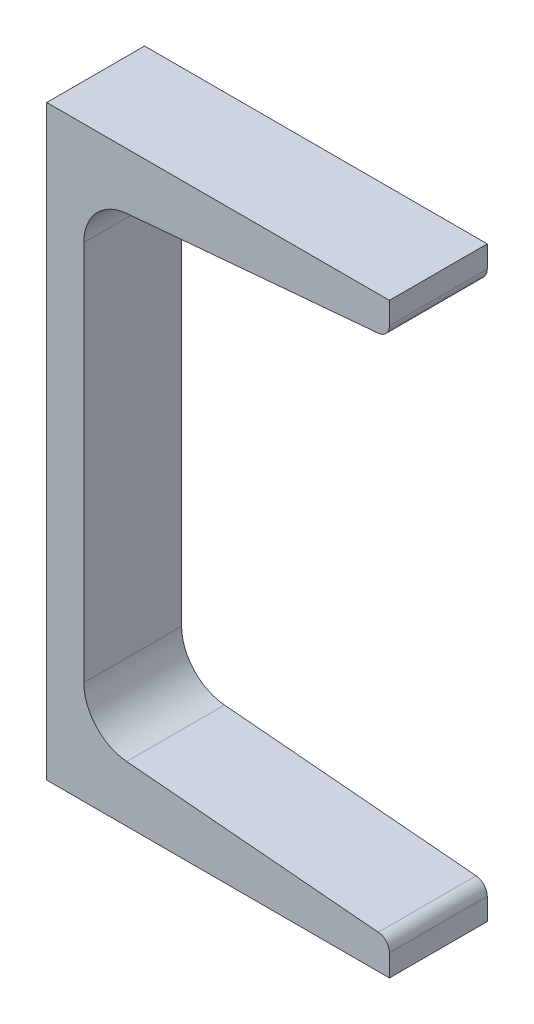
ISO-10303-21;
HEADER;
FILE_DESCRIPTION(('STEP AP214'),'2;1');
FILE_NAME('part.step','',(''),(''),'','','');
FILE_SCHEMA(('AUTOMOTIVE_DESIGN { 1 0 10303 214 1 1 1 1 }'));
ENDSEC;
DATA;
#1=APPLICATION_CONTEXT('core data for automotive mechanical design processes');
#2=APPLICATION_PROTOCOL_DEFINITION('international standard','automotive_design',2000,#1);
#3=PRODUCT_CONTEXT('',#1,'mechanical');
#4=PRODUCT('Part','Part','',(#3));
#5=PRODUCT_RELATED_PRODUCT_CATEGORY('part','',(#4));
#6=PRODUCT_DEFINITION_FORMATION('','',#4);
#7=PRODUCT_DEFINITION_CONTEXT('part definition',#1,'design');
#8=PRODUCT_DEFINITION('design','',#6,#7);
#9=PRODUCT_DEFINITION_SHAPE('','',#8);
#10=(LENGTH_UNIT() NAMED_UNIT(*) SI_UNIT(.MILLI.,.METRE.));
#11=(NAMED_UNIT(*) PLANE_ANGLE_UNIT() SI_UNIT($,.RADIAN.));
#12=(NAMED_UNIT(*) SI_UNIT($,.STERADIAN.) SOLID_ANGLE_UNIT());
#13=UNCERTAINTY_MEASURE_WITH_UNIT(LENGTH_MEASURE(1.E-05),#10,'distance_accuracy_value','');
#14=(GEOMETRIC_REPRESENTATION_CONTEXT(3) GLOBAL_UNCERTAINTY_ASSIGNED_CONTEXT((#13)) GLOBAL_UNIT_ASSIGNED_CONTEXT((#10,
#11,#12)) REPRESENTATION_CONTEXT('',''));
#15=CARTESIAN_POINT('',(0.,0.,0.));
#16=DIRECTION('',(0.,0.,1.));
#17=DIRECTION('',(1.,0.,0.));
#18=AXIS2_PLACEMENT_3D('',#15,#16,#17);
#19=CARTESIAN_POINT('',(0.,152.4,12.7));
#20=DIRECTION('',(1.,0.,0.));
#21=DIRECTION('',(0.,0.,-1.));
#22=AXIS2_PLACEMENT_3D('',#19,#20,#21);
#23=PLANE('',#22);
#24=DIRECTION('',(0.,-1.,0.));
#25=VECTOR('',#24,1.);
#26=CARTESIAN_POINT('',(0.,152.4,-12.7));
#27=LINE('',#26,#25);
#28=CARTESIAN_POINT('',(0.,152.4,-12.7));
#29=VERTEX_POINT('',#28);
#30=CARTESIAN_POINT('',(0.,0.,-12.7));
#31=VERTEX_POINT('',#30);
#32=EDGE_CURVE('E144',#29,#31,#27,.T.);
#33=ORIENTED_EDGE('',*,*,#32,.T.);
#34=DIRECTION('',(0.,0.,-1.));
#35=VECTOR('',#34,1.);
#36=CARTESIAN_POINT('',(0.,0.,12.7));
#37=LINE('',#36,#35);
#38=CARTESIAN_POINT('',(0.,0.,12.7));
#39=VERTEX_POINT('',#38);
#40=EDGE_CURVE('E142',#39,#31,#37,.T.);
#41=ORIENTED_EDGE('',*,*,#40,.F.);
#42=DIRECTION('',(0.,-1.,0.));
#43=VECTOR('',#42,1.);
#44=CARTESIAN_POINT('',(0.,152.4,12.7));
#45=LINE('',#44,#43);
#46=CARTESIAN_POINT('',(0.,152.4,12.7));
#47=VERTEX_POINT('',#46);
#48=EDGE_CURVE('E128',#47,#39,#45,.T.);
#49=ORIENTED_EDGE('',*,*,#48,.F.);
#50=DIRECTION('',(0.,0.,-1.));
#51=VECTOR('',#50,1.);
#52=CARTESIAN_POINT('',(0.,152.4,12.7));
#53=LINE('',#52,#51);
#54=EDGE_CURVE('E173',#47,#29,#53,.T.);
#55=ORIENTED_EDGE('',*,*,#54,.T.);
#56=EDGE_LOOP('',(#33,#41,#49,#55));
#57=FACE_BOUND('',#56,.T.);
#58=ADVANCED_FACE('F39',(#57),#23,.F.);
#59=CARTESIAN_POINT('',(89.0016,0.,12.7));
#60=DIRECTION('',(0.,-1.,0.));
#61=DIRECTION('',(1.,0.,0.));
#62=AXIS2_PLACEMENT_3D('',#59,#60,#61);
#63=PLANE('',#62);
#64=DIRECTION('',(-1.,0.,0.));
#65=VECTOR('',#64,1.);
#66=CARTESIAN_POINT('',(89.0016,0.,-12.7));
#67=LINE('',#66,#65);
#68=CARTESIAN_POINT('',(89.0016,0.,-12.7));
#69=VERTEX_POINT('',#68);
#70=EDGE_CURVE('E175',#69,#31,#67,.T.);
#71=ORIENTED_EDGE('',*,*,#70,.F.);
#72=DIRECTION('',(0.,0.,-1.));
#73=VECTOR('',#72,1.);
#74=CARTESIAN_POINT('',(89.0016,0.,12.7));
#75=LINE('',#74,#73);
#76=CARTESIAN_POINT('',(89.0016,0.,12.7));
#77=VERTEX_POINT('',#76);
#78=EDGE_CURVE('E149',#77,#69,#75,.T.);
#79=ORIENTED_EDGE('',*,*,#78,.F.);
#80=DIRECTION('',(-1.,0.,0.));
#81=VECTOR('',#80,1.);
#82=CARTESIAN_POINT('',(89.0016,0.,12.7));
#83=LINE('',#82,#81);
#84=EDGE_CURVE('E133',#77,#39,#83,.T.);
#85=ORIENTED_EDGE('',*,*,#84,.T.);
#86=ORIENTED_EDGE('',*,*,#40,.T.);
#87=EDGE_LOOP('',(#71,#79,#85,#86));
#88=FACE_BOUND('',#87,.T.);
#89=ADVANCED_FACE('F151',(#88),#63,.T.);
#90=CARTESIAN_POINT('',(89.0016,0.,12.7));
#91=DIRECTION('',(-1.,0.,0.));
#92=DIRECTION('',(0.,-1.,0.));
#93=AXIS2_PLACEMENT_3D('',#90,#91,#92);
#94=PLANE('',#93);
#95=DIRECTION('',(0.,1.,0.));
#96=VECTOR('',#95,1.);
#97=CARTESIAN_POINT('',(89.0016,0.,-12.7));
#98=LINE('',#97,#96);
#99=CARTESIAN_POINT('',(89.0016,5.68344218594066,-12.7));
#100=VERTEX_POINT('',#99);
#101=EDGE_CURVE('E177',#69,#100,#98,.T.);
#102=ORIENTED_EDGE('',*,*,#101,.T.);
#103=DIRECTION('',(0.,0.,-1.));
#104=VECTOR('',#103,1.);
#105=CARTESIAN_POINT('',(89.0016,5.68344218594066,12.7));
#106=LINE('',#105,#104);
#107=CARTESIAN_POINT('',(89.0016,5.68344218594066,12.7));
#108=VERTEX_POINT('',#107);
#109=EDGE_CURVE('E216',#100,#108,#106,.F.);
#110=ORIENTED_EDGE('',*,*,#109,.T.);
#111=DIRECTION('',(0.,1.,0.));
#112=VECTOR('',#111,1.);
#113=CARTESIAN_POINT('',(89.0016,0.,12.7));
#114=LINE('',#113,#112);
#115=EDGE_CURVE('E153',#77,#108,#114,.T.);
#116=ORIENTED_EDGE('',*,*,#115,.F.);
#117=ORIENTED_EDGE('',*,*,#78,.T.);
#118=EDGE_LOOP('',(#102,#110,#116,#117));
#119=FACE_BOUND('',#118,.T.);
#120=ADVANCED_FACE('F249',(#119),#94,.F.);
#121=CARTESIAN_POINT('',(20.7559971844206,14.5635102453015,12.7));
#122=DIRECTION('',(0.0871557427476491,0.996194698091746,0.));
#123=DIRECTION('',(-0.996194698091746,0.0871557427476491,0.));
#124=AXIS2_PLACEMENT_3D('',#121,#122,#123);
#125=PLANE('',#124);
#126=DIRECTION('',(0.996194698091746,-0.0871557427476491,0.));
#127=VECTOR('',#126,1.);
#128=CARTESIAN_POINT('',(20.7559971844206,14.5635102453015,12.7));
#129=LINE('',#128,#127);
#130=CARTESIAN_POINT('',(20.7559971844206,14.5635102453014,12.7));
#131=VERTEX_POINT('',#130);
#132=CARTESIAN_POINT('',(86.1033194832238,8.84636035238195,12.7));
#133=VERTEX_POINT('',#132);
#134=EDGE_CURVE('E155',#131,#133,#129,.T.);
#135=ORIENTED_EDGE('',*,*,#134,.T.);
#136=DIRECTION('',(0.,0.,-1.));
#137=VECTOR('',#136,1.);
#138=CARTESIAN_POINT('',(86.1033194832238,8.84636035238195,-12.7));
#139=LINE('',#138,#137);
#140=CARTESIAN_POINT('',(86.1033194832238,8.84636035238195,-12.7));
#141=VERTEX_POINT('',#140);
#142=EDGE_CURVE('E148',#133,#141,#139,.T.);
#143=ORIENTED_EDGE('',*,*,#142,.T.);
#144=DIRECTION('',(0.996194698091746,-0.0871557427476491,0.));
#145=VECTOR('',#144,1.);
#146=CARTESIAN_POINT('',(20.7559971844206,14.5635102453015,-12.7));
#147=LINE('',#146,#145);
#148=CARTESIAN_POINT('',(20.7559971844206,14.5635102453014,-12.7));
#149=VERTEX_POINT('',#148);
#150=EDGE_CURVE('E180',#149,#141,#147,.T.);
#151=ORIENTED_EDGE('',*,*,#150,.F.);
#152=DIRECTION('',(0.,0.,-1.));
#153=VECTOR('',#152,1.);
#154=CARTESIAN_POINT('',(20.7559971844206,14.5635102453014,12.7));
#155=LINE('',#154,#153);
#156=EDGE_CURVE('E207',#131,#149,#155,.T.);
#157=ORIENTED_EDGE('',*,*,#156,.F.);
#158=EDGE_LOOP('',(#135,#143,#151,#157));
#159=FACE_BOUND('',#158,.T.);
#160=ADVANCED_FACE('F265',(#159),#125,.T.);
#161=CARTESIAN_POINT('',(21.8186,26.709116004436,12.7));
#162=DIRECTION('',(0.,0.,-1.));
#163=DIRECTION('',(-1.,0.,0.));
#164=AXIS2_PLACEMENT_3D('',#161,#162,#163);
#165=CYLINDRICAL_SURFACE('',#164,12.192);
#166=CARTESIAN_POINT('',(21.8186,26.709116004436,-12.7));
#167=DIRECTION('',(0.,0.,1.));
#168=DIRECTION('',(1.,0.,0.));
#169=AXIS2_PLACEMENT_3D('',#166,#167,#168);
#170=CIRCLE('',#169,12.192);
#171=CARTESIAN_POINT('',(9.62659999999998,26.709116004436,-12.7));
#172=VERTEX_POINT('',#171);
#173=EDGE_CURVE('E183',#172,#149,#170,.T.);
#174=ORIENTED_EDGE('',*,*,#173,.F.);
#175=DIRECTION('',(0.,0.,-1.));
#176=VECTOR('',#175,1.);
#177=CARTESIAN_POINT('',(9.62659999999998,26.709116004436,12.7));
#178=LINE('',#177,#176);
#179=CARTESIAN_POINT('',(9.62659999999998,26.709116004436,12.7));
#180=VERTEX_POINT('',#179);
#181=EDGE_CURVE('E205',#180,#172,#178,.T.);
#182=ORIENTED_EDGE('',*,*,#181,.F.);
#183=CARTESIAN_POINT('',(21.8186,26.709116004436,12.7));
#184=DIRECTION('',(0.,0.,1.));
#185=DIRECTION('',(1.,0.,0.));
#186=AXIS2_PLACEMENT_3D('',#183,#184,#185);
#187=CIRCLE('',#186,12.192);
#188=EDGE_CURVE('E160',#180,#131,#187,.T.);
#189=ORIENTED_EDGE('',*,*,#188,.T.);
#190=ORIENTED_EDGE('',*,*,#156,.T.);
#191=EDGE_LOOP('',(#174,#182,#189,#190));
#192=FACE_BOUND('',#191,.T.);
#193=ADVANCED_FACE('F269',(#192),#165,.F.);
#194=CARTESIAN_POINT('',(9.62659999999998,125.690883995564,12.7));
#195=DIRECTION('',(1.,0.,0.));
#196=DIRECTION('',(0.,0.,-1.));
#197=AXIS2_PLACEMENT_3D('',#194,#195,#196);
#198=PLANE('',#197);
#199=DIRECTION('',(0.,-1.,0.));
#200=VECTOR('',#199,1.);
#201=CARTESIAN_POINT('',(9.62659999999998,125.690883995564,-12.7));
#202=LINE('',#201,#200);
#203=CARTESIAN_POINT('',(9.62659999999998,125.690883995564,-12.7));
#204=VERTEX_POINT('',#203);
#205=EDGE_CURVE('E186',#204,#172,#202,.T.);
#206=ORIENTED_EDGE('',*,*,#205,.F.);
#207=DIRECTION('',(0.,0.,-1.));
#208=VECTOR('',#207,1.);
#209=CARTESIAN_POINT('',(9.62659999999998,125.690883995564,12.7));
#210=LINE('',#209,#208);
#211=CARTESIAN_POINT('',(9.62659999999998,125.690883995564,12.7));
#212=VERTEX_POINT('',#211);
#213=EDGE_CURVE('E203',#212,#204,#210,.T.);
#214=ORIENTED_EDGE('',*,*,#213,.F.);
#215=DIRECTION('',(0.,-1.,0.));
#216=VECTOR('',#215,1.);
#217=CARTESIAN_POINT('',(9.62659999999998,125.690883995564,12.7));
#218=LINE('',#217,#216);
#219=EDGE_CURVE('E163',#212,#180,#218,.T.);
#220=ORIENTED_EDGE('',*,*,#219,.T.);
#221=ORIENTED_EDGE('',*,*,#181,.T.);
#222=EDGE_LOOP('',(#206,#214,#220,#221));
#223=FACE_BOUND('',#222,.T.);
#224=ADVANCED_FACE('F273',(#223),#198,.T.);
#225=CARTESIAN_POINT('',(21.8186,125.690883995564,12.7));
#226=DIRECTION('',(0.,0.,-1.));
#227=DIRECTION('',(-1.,0.,0.));
#228=AXIS2_PLACEMENT_3D('',#225,#226,#227);
#229=CYLINDRICAL_SURFACE('',#228,12.192);
#230=CARTESIAN_POINT('',(21.8186,125.690883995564,-12.7));
#231=DIRECTION('',(0.,0.,-1.));
#232=DIRECTION('',(-1.,0.,0.));
#233=AXIS2_PLACEMENT_3D('',#230,#231,#232);
#234=CIRCLE('',#233,12.192);
#235=CARTESIAN_POINT('',(20.7559971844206,137.836489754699,-12.7));
#236=VERTEX_POINT('',#235);
#237=EDGE_CURVE('E189',#204,#236,#234,.T.);
#238=ORIENTED_EDGE('',*,*,#237,.T.);
#239=DIRECTION('',(0.,0.,-1.));
#240=VECTOR('',#239,1.);
#241=CARTESIAN_POINT('',(20.7559971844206,137.836489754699,12.7));
#242=LINE('',#241,#240);
#243=CARTESIAN_POINT('',(20.7559971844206,137.836489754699,12.7));
#244=VERTEX_POINT('',#243);
#245=EDGE_CURVE('E200',#244,#236,#242,.T.);
#246=ORIENTED_EDGE('',*,*,#245,.F.);
#247=CARTESIAN_POINT('',(21.8186,125.690883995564,12.7));
#248=DIRECTION('',(0.,0.,-1.));
#249=DIRECTION('',(-1.,0.,0.));
#250=AXIS2_PLACEMENT_3D('',#247,#248,#249);
#251=CIRCLE('',#250,12.192);
#252=EDGE_CURVE('E166',#212,#244,#251,.T.);
#253=ORIENTED_EDGE('',*,*,#252,.F.);
#254=ORIENTED_EDGE('',*,*,#213,.T.);
#255=EDGE_LOOP('',(#238,#246,#253,#254));
#256=FACE_BOUND('',#255,.T.);
#257=ADVANCED_FACE('F278',(#256),#229,.F.);
#258=CARTESIAN_POINT('',(20.7559971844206,137.836489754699,12.7));
#259=DIRECTION('',(-0.0871557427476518,0.996194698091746,0.));
#260=DIRECTION('',(-0.996194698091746,-0.0871557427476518,0.));
#261=AXIS2_PLACEMENT_3D('',#258,#259,#260);
#262=PLANE('',#261);
#263=DIRECTION('',(0.996194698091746,0.0871557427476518,0.));
#264=VECTOR('',#263,1.);
#265=CARTESIAN_POINT('',(20.7559971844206,137.836489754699,-12.7));
#266=LINE('',#265,#264);
#267=CARTESIAN_POINT('',(86.1033194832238,143.553639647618,-12.7));
#268=VERTEX_POINT('',#267);
#269=EDGE_CURVE('E191',#236,#268,#266,.T.);
#270=ORIENTED_EDGE('',*,*,#269,.T.);
#271=DIRECTION('',(0.,0.,-1.));
#272=VECTOR('',#271,1.);
#273=CARTESIAN_POINT('',(86.1033194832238,143.553639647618,12.7));
#274=LINE('',#273,#272);
#275=CARTESIAN_POINT('',(86.1033194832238,143.553639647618,12.7));
#276=VERTEX_POINT('',#275);
#277=EDGE_CURVE('E11',#268,#276,#274,.F.);
#278=ORIENTED_EDGE('',*,*,#277,.T.);
#279=DIRECTION('',(0.996194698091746,0.0871557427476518,0.));
#280=VECTOR('',#279,1.);
#281=CARTESIAN_POINT('',(20.7559971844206,137.836489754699,12.7));
#282=LINE('',#281,#280);
#283=EDGE_CURVE('E168',#244,#276,#282,.T.);
#284=ORIENTED_EDGE('',*,*,#283,.F.);
#285=ORIENTED_EDGE('',*,*,#245,.T.);
#286=EDGE_LOOP('',(#270,#278,#284,#285));
#287=FACE_BOUND('',#286,.T.);
#288=ADVANCED_FACE('F241',(#287),#262,.F.);
#289=CARTESIAN_POINT('',(89.0016,152.4,12.7));
#290=DIRECTION('',(1.,0.,0.));
#291=DIRECTION('',(0.,1.,0.));
#292=AXIS2_PLACEMENT_3D('',#289,#290,#291);
#293=PLANE('',#292);
#294=DIRECTION('',(0.,-1.,0.));
#295=VECTOR('',#294,1.);
#296=CARTESIAN_POINT('',(89.0016,152.4,12.7));
#297=LINE('',#296,#295);
#298=CARTESIAN_POINT('',(89.0016,152.4,12.7));
#299=VERTEX_POINT('',#298);
#300=CARTESIAN_POINT('',(89.0016,146.716557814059,12.7));
#301=VERTEX_POINT('',#300);
#302=EDGE_CURVE('E170',#299,#301,#297,.T.);
#303=ORIENTED_EDGE('',*,*,#302,.T.);
#304=DIRECTION('',(0.,0.,-1.));
#305=VECTOR('',#304,1.);
#306=CARTESIAN_POINT('',(89.0016,146.716557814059,-12.7));
#307=LINE('',#306,#305);
#308=CARTESIAN_POINT('',(89.0016,146.716557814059,-12.7));
#309=VERTEX_POINT('',#308);
#310=EDGE_CURVE('E47',#301,#309,#307,.T.);
#311=ORIENTED_EDGE('',*,*,#310,.T.);
#312=DIRECTION('',(0.,-1.,0.));
#313=VECTOR('',#312,1.);
#314=CARTESIAN_POINT('',(89.0016,152.4,-12.7));
#315=LINE('',#314,#313);
#316=CARTESIAN_POINT('',(89.0016,152.4,-12.7));
#317=VERTEX_POINT('',#316);
#318=EDGE_CURVE('E193',#317,#309,#315,.T.);
#319=ORIENTED_EDGE('',*,*,#318,.F.);
#320=DIRECTION('',(0.,0.,-1.));
#321=VECTOR('',#320,1.);
#322=CARTESIAN_POINT('',(89.0016,152.4,12.7));
#323=LINE('',#322,#321);
#324=EDGE_CURVE('E198',#299,#317,#323,.T.);
#325=ORIENTED_EDGE('',*,*,#324,.F.);
#326=EDGE_LOOP('',(#303,#311,#319,#325));
#327=FACE_BOUND('',#326,.T.);
#328=ADVANCED_FACE('F224',(#327),#293,.T.);
#329=CARTESIAN_POINT('',(89.0016,152.4,12.7));
#330=DIRECTION('',(0.,-1.,0.));
#331=DIRECTION('',(0.,0.,-1.));
#332=AXIS2_PLACEMENT_3D('',#329,#330,#331);
#333=PLANE('',#332);
#334=DIRECTION('',(-1.,0.,0.));
#335=VECTOR('',#334,1.);
#336=CARTESIAN_POINT('',(89.0016,152.4,-12.7));
#337=LINE('',#336,#335);
#338=EDGE_CURVE('E139',#317,#29,#337,.T.);
#339=ORIENTED_EDGE('',*,*,#338,.T.);
#340=ORIENTED_EDGE('',*,*,#54,.F.);
#341=DIRECTION('',(-1.,0.,0.));
#342=VECTOR('',#341,1.);
#343=CARTESIAN_POINT('',(89.0016,152.4,12.7));
#344=LINE('',#343,#342);
#345=EDGE_CURVE('E135',#299,#47,#344,.T.);
#346=ORIENTED_EDGE('',*,*,#345,.F.);
#347=ORIENTED_EDGE('',*,*,#324,.T.);
#348=EDGE_LOOP('',(#339,#340,#346,#347));
#349=FACE_BOUND('',#348,.T.);
#350=ADVANCED_FACE('F231',(#349),#333,.F.);
#351=CARTESIAN_POINT('',(21.8186,26.709116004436,12.7));
#352=DIRECTION('',(0.,0.,1.));
#353=DIRECTION('',(1.,0.,0.));
#354=AXIS2_PLACEMENT_3D('',#351,#352,#353);
#355=PLANE('',#354);
#356=ORIENTED_EDGE('',*,*,#115,.T.);
#357=CARTESIAN_POINT('',(85.8266,5.68344218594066,12.7));
#358=DIRECTION('',(0.,0.,1.));
#359=DIRECTION('',(1.,0.,0.));
#360=AXIS2_PLACEMENT_3D('',#357,#358,#359);
#361=CIRCLE('',#360,3.175);
#362=EDGE_CURVE('E219',#108,#133,#361,.T.);
#363=ORIENTED_EDGE('',*,*,#362,.T.);
#364=ORIENTED_EDGE('',*,*,#134,.F.);
#365=ORIENTED_EDGE('',*,*,#188,.F.);
#366=ORIENTED_EDGE('',*,*,#219,.F.);
#367=ORIENTED_EDGE('',*,*,#252,.T.);
#368=ORIENTED_EDGE('',*,*,#283,.T.);
#369=CARTESIAN_POINT('',(85.8266,146.71655781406,12.7));
#370=DIRECTION('',(0.,0.,1.));
#371=DIRECTION('',(1.,0.,0.));
#372=AXIS2_PLACEMENT_3D('',#369,#370,#371);
#373=CIRCLE('',#372,3.175);
#374=EDGE_CURVE('E54',#276,#301,#373,.T.);
#375=ORIENTED_EDGE('',*,*,#374,.T.);
#376=ORIENTED_EDGE('',*,*,#302,.F.);
#377=ORIENTED_EDGE('',*,*,#345,.T.);
#378=ORIENTED_EDGE('',*,*,#48,.T.);
#379=ORIENTED_EDGE('',*,*,#84,.F.);
#380=EDGE_LOOP('',(#356,#363,#364,#365,#366,#367,#368,#375,#376,#377,#378,#379));
#381=FACE_BOUND('',#380,.T.);
#382=ADVANCED_FACE('F131',(#381),#355,.T.);
#383=CARTESIAN_POINT('',(21.8186,26.709116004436,-12.7));
#384=DIRECTION('',(0.,0.,1.));
#385=DIRECTION('',(1.,0.,0.));
#386=AXIS2_PLACEMENT_3D('',#383,#384,#385);
#387=PLANE('',#386);
#388=ORIENTED_EDGE('',*,*,#150,.T.);
#389=CARTESIAN_POINT('',(85.8266,5.68344218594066,-12.7));
#390=DIRECTION('',(0.,0.,1.));
#391=DIRECTION('',(1.,0.,0.));
#392=AXIS2_PLACEMENT_3D('',#389,#390,#391);
#393=CIRCLE('',#392,3.175);
#394=EDGE_CURVE('E214',#141,#100,#393,.F.);
#395=ORIENTED_EDGE('',*,*,#394,.T.);
#396=ORIENTED_EDGE('',*,*,#101,.F.);
#397=ORIENTED_EDGE('',*,*,#70,.T.);
#398=ORIENTED_EDGE('',*,*,#32,.F.);
#399=ORIENTED_EDGE('',*,*,#338,.F.);
#400=ORIENTED_EDGE('',*,*,#318,.T.);
#401=CARTESIAN_POINT('',(85.8266,146.71655781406,-12.7));
#402=DIRECTION('',(0.,0.,1.));
#403=DIRECTION('',(1.,0.,0.));
#404=AXIS2_PLACEMENT_3D('',#401,#402,#403);
#405=CIRCLE('',#404,3.175);
#406=EDGE_CURVE('E212',#309,#268,#405,.F.);
#407=ORIENTED_EDGE('',*,*,#406,.T.);
#408=ORIENTED_EDGE('',*,*,#269,.F.);
#409=ORIENTED_EDGE('',*,*,#237,.F.);
#410=ORIENTED_EDGE('',*,*,#205,.T.);
#411=ORIENTED_EDGE('',*,*,#173,.T.);
#412=EDGE_LOOP('',(#388,#395,#396,#397,#398,#399,#400,#407,#408,#409,#410,#411));
#413=FACE_BOUND('',#412,.T.);
#414=ADVANCED_FACE('F228',(#413),#387,.F.);
#415=CARTESIAN_POINT('',(85.8266,5.68344218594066,12.7));
#416=DIRECTION('',(0.,0.,1.));
#417=DIRECTION('',(1.,0.,0.));
#418=AXIS2_PLACEMENT_3D('',#415,#416,#417);
#419=CYLINDRICAL_SURFACE('',#418,3.175);
#420=ORIENTED_EDGE('',*,*,#362,.F.);
#421=ORIENTED_EDGE('',*,*,#109,.F.);
#422=ORIENTED_EDGE('',*,*,#394,.F.);
#423=ORIENTED_EDGE('',*,*,#142,.F.);
#424=EDGE_LOOP('',(#420,#421,#422,#423));
#425=FACE_BOUND('',#424,.T.);
#426=ADVANCED_FACE('F252',(#425),#419,.T.);
#427=CARTESIAN_POINT('',(85.8266,146.71655781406,12.7));
#428=DIRECTION('',(0.,0.,1.));
#429=DIRECTION('',(1.,0.,0.));
#430=AXIS2_PLACEMENT_3D('',#427,#428,#429);
#431=CYLINDRICAL_SURFACE('',#430,3.175);
#432=ORIENTED_EDGE('',*,*,#374,.F.);
#433=ORIENTED_EDGE('',*,*,#277,.F.);
#434=ORIENTED_EDGE('',*,*,#406,.F.);
#435=ORIENTED_EDGE('',*,*,#310,.F.);
#436=EDGE_LOOP('',(#432,#433,#434,#435));
#437=FACE_BOUND('',#436,.T.);
#438=ADVANCED_FACE('F41',(#437),#431,.T.);
#439=CLOSED_SHELL('',(#58,#89,#120,#160,#193,#224,#257,#288,#328,#350,#382,#414,#426,#438));
#440=MANIFOLD_SOLID_BREP('B2',#439);
#441=ADVANCED_BREP_SHAPE_REPRESENTATION('',(#18,#440),#14);
#442=SHAPE_DEFINITION_REPRESENTATION(#9,#441);
ENDSEC;
END-ISO-10303-21;
